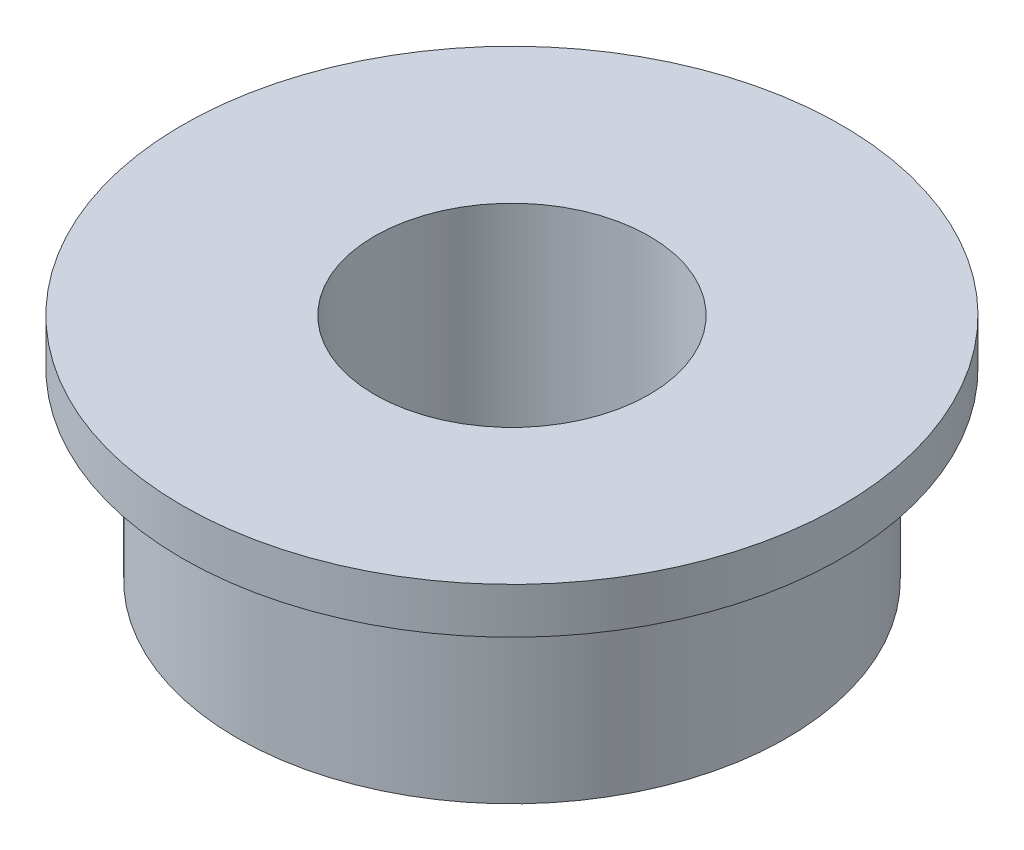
from build123d import *

# Parameters (mm, degrees)
SKETCH1_R           = 3
SKETCH1_R_2         = 1.5
BOSS_EXTRUDE1_DEPTH = 2
SKETCH2_R           = 3.6
SKETCH2_R_2         = 1.5
BOSS_EXTRUDE2_DEPTH = 0.5
SKETCH3_R           = 2.786493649
CUT_EXTRUDE1_DEPTH  = 0.1


with BuildPart() as part:
    # Sketch1 → Boss-Extrude1 (new body)
    with BuildSketch(Plane(origin=(0, 0, 0), x_dir=(1, 0, 0), z_dir=(0, 1, 0))):
        with Locations(Location((0, 0, 0), (0, 0, 270))):
            Circle(SKETCH1_R)
        with Locations(Location((0, 0, 0), (0, 0, 270))):
            Circle(SKETCH1_R_2, mode=Mode.SUBTRACT)
    extrude(amount=BOSS_EXTRUDE1_DEPTH)

    # Sketch2 → Boss-Extrude2 (add)
    with BuildSketch(Plane(origin=(0, 2, 0), x_dir=(1, 0, 0), z_dir=(0, 1, 0))):
        with Locations(Location((0, 0, 0), (0, 0, 270))):
            Circle(SKETCH2_R)
        with Locations(Location((0, 0, 0), (0, 0, 270))):
            Circle(SKETCH2_R_2, mode=Mode.SUBTRACT)
    extrude(amount=BOSS_EXTRUDE2_DEPTH)

    # Sketch3 → Cut-Extrude1 (cut)
    with BuildSketch(Plane.XZ):
        with Locations(Location((0, 0, 0), (0, 0, 270))):
            Circle(SKETCH3_R)
    extrude(amount=-CUT_EXTRUDE1_DEPTH, mode=Mode.SUBTRACT)


solid = part.part
